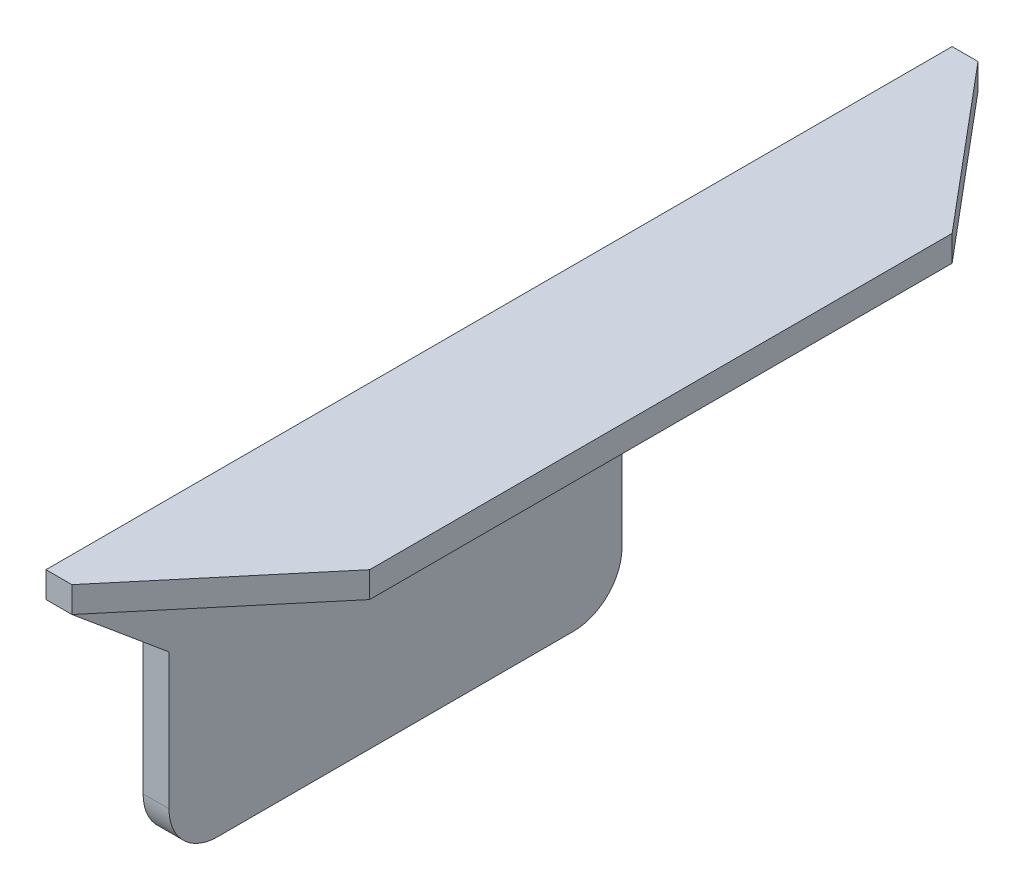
ISO-10303-21;
HEADER;
FILE_DESCRIPTION(('STEP AP214'),'2;1');
FILE_NAME('part.step','',(''),(''),'','','');
FILE_SCHEMA(('AUTOMOTIVE_DESIGN { 1 0 10303 214 1 1 1 1 }'));
ENDSEC;
DATA;
#1=APPLICATION_CONTEXT('core data for automotive mechanical design processes');
#2=APPLICATION_PROTOCOL_DEFINITION('international standard','automotive_design',2000,#1);
#3=PRODUCT_CONTEXT('',#1,'mechanical');
#4=PRODUCT('Part','Part','',(#3));
#5=PRODUCT_RELATED_PRODUCT_CATEGORY('part','',(#4));
#6=PRODUCT_DEFINITION_FORMATION('','',#4);
#7=PRODUCT_DEFINITION_CONTEXT('part definition',#1,'design');
#8=PRODUCT_DEFINITION('design','',#6,#7);
#9=PRODUCT_DEFINITION_SHAPE('','',#8);
#10=(LENGTH_UNIT() NAMED_UNIT(*) SI_UNIT(.MILLI.,.METRE.));
#11=(NAMED_UNIT(*) PLANE_ANGLE_UNIT() SI_UNIT($,.RADIAN.));
#12=(NAMED_UNIT(*) SI_UNIT($,.STERADIAN.) SOLID_ANGLE_UNIT());
#13=UNCERTAINTY_MEASURE_WITH_UNIT(LENGTH_MEASURE(1.E-05),#10,'distance_accuracy_value','');
#14=(GEOMETRIC_REPRESENTATION_CONTEXT(3) GLOBAL_UNCERTAINTY_ASSIGNED_CONTEXT((#13)) GLOBAL_UNIT_ASSIGNED_CONTEXT((#10,
#11,#12)) REPRESENTATION_CONTEXT('',''));
#15=CARTESIAN_POINT('',(0.,0.,0.));
#16=DIRECTION('',(0.,0.,1.));
#17=DIRECTION('',(1.,0.,0.));
#18=AXIS2_PLACEMENT_3D('',#15,#16,#17);
#19=CARTESIAN_POINT('',(0.,0.,280.));
#20=DIRECTION('',(1.,0.,0.));
#21=DIRECTION('',(0.,1.,0.));
#22=AXIS2_PLACEMENT_3D('',#19,#20,#21);
#23=PLANE('',#22);
#24=CARTESIAN_POINT('',(0.,-75.,125.));
#25=DIRECTION('',(1.,0.,0.));
#26=DIRECTION('',(0.,0.,-1.));
#27=AXIS2_PLACEMENT_3D('',#24,#25,#26);
#28=CIRCLE('',#27,15.);
#29=CARTESIAN_POINT('',(0.,-90.,125.));
#30=VERTEX_POINT('',#29);
#31=CARTESIAN_POINT('',(0.,-75.,110.));
#32=VERTEX_POINT('',#31);
#33=EDGE_CURVE('E223',#30,#32,#28,.T.);
#34=ORIENTED_EDGE('',*,*,#33,.F.);
#35=DIRECTION('',(0.,0.,-1.));
#36=VECTOR('',#35,1.);
#37=CARTESIAN_POINT('',(0.,-90.,280.));
#38=LINE('',#37,#36);
#39=CARTESIAN_POINT('',(0.,-90.,235.));
#40=VERTEX_POINT('',#39);
#41=EDGE_CURVE('E179',#40,#30,#38,.T.);
#42=ORIENTED_EDGE('',*,*,#41,.F.);
#43=CARTESIAN_POINT('',(0.,-75.,235.));
#44=DIRECTION('',(1.,0.,0.));
#45=DIRECTION('',(0.,0.,-1.));
#46=AXIS2_PLACEMENT_3D('',#43,#44,#45);
#47=CIRCLE('',#46,15.);
#48=CARTESIAN_POINT('',(0.,-75.,250.));
#49=VERTEX_POINT('',#48);
#50=EDGE_CURVE('E243',#49,#40,#47,.T.);
#51=ORIENTED_EDGE('',*,*,#50,.F.);
#52=DIRECTION('',(0.,-1.,0.));
#53=VECTOR('',#52,1.);
#54=CARTESIAN_POINT('',(0.,-49.,250.));
#55=LINE('',#54,#53);
#56=CARTESIAN_POINT('',(0.,-33.0000000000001,250.));
#57=VERTEX_POINT('',#56);
#58=EDGE_CURVE('E245',#57,#49,#55,.T.);
#59=ORIENTED_EDGE('',*,*,#58,.F.);
#60=DIRECTION('',(0.,-0.640184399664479,-0.768221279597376));
#61=VECTOR('',#60,1.);
#62=CARTESIAN_POINT('',(0.,-205.333235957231,43.2001168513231));
#63=LINE('',#62,#61);
#64=CARTESIAN_POINT('',(0.,-8.00000000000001,280.));
#65=VERTEX_POINT('',#64);
#66=EDGE_CURVE('E248',#65,#57,#63,.T.);
#67=ORIENTED_EDGE('',*,*,#66,.F.);
#68=DIRECTION('',(0.,-1.,0.));
#69=VECTOR('',#68,1.);
#70=CARTESIAN_POINT('',(0.,0.,280.));
#71=LINE('',#70,#69);
#72=CARTESIAN_POINT('',(0.,0.,280.));
#73=VERTEX_POINT('',#72);
#74=EDGE_CURVE('E181',#73,#65,#71,.T.);
#75=ORIENTED_EDGE('',*,*,#74,.F.);
#76=DIRECTION('',(0.,0.,-1.));
#77=VECTOR('',#76,1.);
#78=CARTESIAN_POINT('',(0.,0.,280.));
#79=LINE('',#78,#77);
#80=CARTESIAN_POINT('',(0.,0.,0.));
#81=VERTEX_POINT('',#80);
#82=EDGE_CURVE('E47',#73,#81,#79,.T.);
#83=ORIENTED_EDGE('',*,*,#82,.T.);
#84=DIRECTION('',(0.,-1.,0.));
#85=VECTOR('',#84,1.);
#86=CARTESIAN_POINT('',(0.,0.,0.));
#87=LINE('',#86,#85);
#88=CARTESIAN_POINT('',(0.,-8.,0.));
#89=VERTEX_POINT('',#88);
#90=EDGE_CURVE('E191',#81,#89,#87,.T.);
#91=ORIENTED_EDGE('',*,*,#90,.T.);
#92=DIRECTION('',(0.,0.52999894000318,-0.847998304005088));
#93=VECTOR('',#92,1.);
#94=CARTESIAN_POINT('',(0.,19.6191369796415,-44.1906191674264));
#95=LINE('',#94,#93);
#96=CARTESIAN_POINT('',(0.,-33.,40.));
#97=VERTEX_POINT('',#96);
#98=EDGE_CURVE('E62',#97,#89,#95,.T.);
#99=ORIENTED_EDGE('',*,*,#98,.F.);
#100=DIRECTION('',(0.,0.,-1.));
#101=VECTOR('',#100,1.);
#102=CARTESIAN_POINT('',(0.,-33.,-87.0775797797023));
#103=LINE('',#102,#101);
#104=CARTESIAN_POINT('',(0.,-33.,110.));
#105=VERTEX_POINT('',#104);
#106=EDGE_CURVE('E227',#105,#97,#103,.T.);
#107=ORIENTED_EDGE('',*,*,#106,.F.);
#108=DIRECTION('',(0.,1.,0.));
#109=VECTOR('',#108,1.);
#110=CARTESIAN_POINT('',(0.,-48.9999999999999,110.));
#111=LINE('',#110,#109);
#112=EDGE_CURVE('E229',#32,#105,#111,.T.);
#113=ORIENTED_EDGE('',*,*,#112,.F.);
#114=EDGE_LOOP('',(#34,#42,#51,#59,#67,#75,#83,#91,#99,#107,#113));
#115=FACE_BOUND('',#114,.T.);
#116=ADVANCED_FACE('F39',(#115),#23,.F.);
#117=CARTESIAN_POINT('',(8.00000000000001,-90.,280.));
#118=DIRECTION('',(-1.,0.,0.));
#119=DIRECTION('',(0.,0.,1.));
#120=AXIS2_PLACEMENT_3D('',#117,#118,#119);
#121=PLANE('',#120);
#122=CARTESIAN_POINT('',(8.00000000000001,-75.,125.));
#123=DIRECTION('',(1.,0.,0.));
#124=DIRECTION('',(0.,0.,-1.));
#125=AXIS2_PLACEMENT_3D('',#122,#123,#124);
#126=CIRCLE('',#125,15.);
#127=CARTESIAN_POINT('',(8.00000000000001,-90.,125.));
#128=VERTEX_POINT('',#127);
#129=CARTESIAN_POINT('',(8.00000000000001,-75.,110.));
#130=VERTEX_POINT('',#129);
#131=EDGE_CURVE('E169',#128,#130,#126,.T.);
#132=ORIENTED_EDGE('',*,*,#131,.T.);
#133=DIRECTION('',(0.,1.,0.));
#134=VECTOR('',#133,1.);
#135=CARTESIAN_POINT('',(8.00000000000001,-48.9999999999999,110.));
#136=LINE('',#135,#134);
#137=CARTESIAN_POINT('',(8.00000000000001,-33.,110.));
#138=VERTEX_POINT('',#137);
#139=EDGE_CURVE('E225',#130,#138,#136,.T.);
#140=ORIENTED_EDGE('',*,*,#139,.T.);
#141=DIRECTION('',(0.,0.,-1.));
#142=VECTOR('',#141,1.);
#143=CARTESIAN_POINT('',(8.00000000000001,-33.,-87.0775797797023));
#144=LINE('',#143,#142);
#145=CARTESIAN_POINT('',(8.00000000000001,-33.,40.));
#146=VERTEX_POINT('',#145);
#147=EDGE_CURVE('E168',#138,#146,#144,.T.);
#148=ORIENTED_EDGE('',*,*,#147,.T.);
#149=DIRECTION('',(0.,0.52999894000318,-0.847998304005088));
#150=VECTOR('',#149,1.);
#151=CARTESIAN_POINT('',(8.00000000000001,19.6191369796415,-44.1906191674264));
#152=LINE('',#151,#150);
#153=CARTESIAN_POINT('',(8.00000000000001,-8.,0.));
#154=VERTEX_POINT('',#153);
#155=EDGE_CURVE('E155',#146,#154,#152,.T.);
#156=ORIENTED_EDGE('',*,*,#155,.T.);
#157=DIRECTION('',(0.,0.,-1.));
#158=VECTOR('',#157,1.);
#159=CARTESIAN_POINT('',(8.00000000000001,-8.,280.));
#160=LINE('',#159,#158);
#161=CARTESIAN_POINT('',(8.00000000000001,-8.,280.));
#162=VERTEX_POINT('',#161);
#163=EDGE_CURVE('E165',#162,#154,#160,.T.);
#164=ORIENTED_EDGE('',*,*,#163,.F.);
#165=DIRECTION('',(0.,-0.640184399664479,-0.768221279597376));
#166=VECTOR('',#165,1.);
#167=CARTESIAN_POINT('',(8.00000000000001,-205.333235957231,43.2001168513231));
#168=LINE('',#167,#166);
#169=CARTESIAN_POINT('',(8.00000000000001,-33.0000000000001,250.));
#170=VERTEX_POINT('',#169);
#171=EDGE_CURVE('E246',#162,#170,#168,.T.);
#172=ORIENTED_EDGE('',*,*,#171,.T.);
#173=DIRECTION('',(0.,-1.,0.));
#174=VECTOR('',#173,1.);
#175=CARTESIAN_POINT('',(8.00000000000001,-49.,250.));
#176=LINE('',#175,#174);
#177=CARTESIAN_POINT('',(8.00000000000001,-75.,250.));
#178=VERTEX_POINT('',#177);
#179=EDGE_CURVE('E253',#170,#178,#176,.T.);
#180=ORIENTED_EDGE('',*,*,#179,.T.);
#181=CARTESIAN_POINT('',(8.00000000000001,-75.,235.));
#182=DIRECTION('',(1.,0.,0.));
#183=DIRECTION('',(0.,0.,-1.));
#184=AXIS2_PLACEMENT_3D('',#181,#182,#183);
#185=CIRCLE('',#184,15.);
#186=CARTESIAN_POINT('',(8.00000000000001,-90.,235.));
#187=VERTEX_POINT('',#186);
#188=EDGE_CURVE('E237',#178,#187,#185,.T.);
#189=ORIENTED_EDGE('',*,*,#188,.T.);
#190=DIRECTION('',(0.,0.,-1.));
#191=VECTOR('',#190,1.);
#192=CARTESIAN_POINT('',(8.00000000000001,-90.,280.));
#193=LINE('',#192,#191);
#194=EDGE_CURVE('E175',#187,#128,#193,.T.);
#195=ORIENTED_EDGE('',*,*,#194,.T.);
#196=EDGE_LOOP('',(#132,#140,#148,#156,#164,#172,#180,#189,#195));
#197=FACE_BOUND('',#196,.T.);
#198=ADVANCED_FACE('F163',(#197),#121,.F.);
#199=CARTESIAN_POINT('',(50.,-90.,0.));
#200=DIRECTION('',(0.,0.,-1.));
#201=DIRECTION('',(-1.,0.,0.));
#202=AXIS2_PLACEMENT_3D('',#199,#200,#201);
#203=PLANE('',#202);
#204=DIRECTION('',(0.,-1.,0.));
#205=VECTOR('',#204,1.);
#206=CARTESIAN_POINT('',(8.00000000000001,272.,0.));
#207=LINE('',#206,#205);
#208=CARTESIAN_POINT('',(8.00000000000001,0.,0.));
#209=VERTEX_POINT('',#208);
#210=EDGE_CURVE('E136',#209,#154,#207,.T.);
#211=ORIENTED_EDGE('',*,*,#210,.T.);
#212=DIRECTION('',(1.,0.,0.));
#213=VECTOR('',#212,1.);
#214=CARTESIAN_POINT('',(0.,-8.,0.));
#215=LINE('',#214,#213);
#216=EDGE_CURVE('E147',#89,#154,#215,.T.);
#217=ORIENTED_EDGE('',*,*,#216,.F.);
#218=ORIENTED_EDGE('',*,*,#90,.F.);
#219=DIRECTION('',(-1.,0.,0.));
#220=VECTOR('',#219,1.);
#221=CARTESIAN_POINT('',(50.,0.,0.));
#222=LINE('',#221,#220);
#223=EDGE_CURVE('E149',#209,#81,#222,.T.);
#224=ORIENTED_EDGE('',*,*,#223,.F.);
#225=EDGE_LOOP('',(#211,#217,#218,#224));
#226=FACE_BOUND('',#225,.T.);
#227=ADVANCED_FACE('F145',(#226),#203,.T.);
#228=CARTESIAN_POINT('',(0.,-90.,280.));
#229=DIRECTION('',(0.,1.,0.));
#230=DIRECTION('',(0.,0.,1.));
#231=AXIS2_PLACEMENT_3D('',#228,#229,#230);
#232=PLANE('',#231);
#233=ORIENTED_EDGE('',*,*,#41,.T.);
#234=DIRECTION('',(1.,0.,0.));
#235=VECTOR('',#234,1.);
#236=CARTESIAN_POINT('',(0.,-90.,125.));
#237=LINE('',#236,#235);
#238=EDGE_CURVE('E158',#30,#128,#237,.T.);
#239=ORIENTED_EDGE('',*,*,#238,.T.);
#240=ORIENTED_EDGE('',*,*,#194,.F.);
#241=DIRECTION('',(1.,0.,0.));
#242=VECTOR('',#241,1.);
#243=CARTESIAN_POINT('',(0.,-90.,235.));
#244=LINE('',#243,#242);
#245=EDGE_CURVE('E199',#40,#187,#244,.T.);
#246=ORIENTED_EDGE('',*,*,#245,.F.);
#247=EDGE_LOOP('',(#233,#239,#240,#246));
#248=FACE_BOUND('',#247,.T.);
#249=ADVANCED_FACE('F276',(#248),#232,.F.);
#250=CARTESIAN_POINT('',(50.,-90.,280.));
#251=DIRECTION('',(0.,0.,-1.));
#252=DIRECTION('',(-1.,0.,0.));
#253=AXIS2_PLACEMENT_3D('',#250,#251,#252);
#254=PLANE('',#253);
#255=DIRECTION('',(1.,0.,0.));
#256=VECTOR('',#255,1.);
#257=CARTESIAN_POINT('',(0.,-8.00000000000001,280.));
#258=LINE('',#257,#256);
#259=EDGE_CURVE('E206',#65,#162,#258,.T.);
#260=ORIENTED_EDGE('',*,*,#259,.T.);
#261=DIRECTION('',(0.,-1.,0.));
#262=VECTOR('',#261,1.);
#263=CARTESIAN_POINT('',(8.00000000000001,272.,280.));
#264=LINE('',#263,#262);
#265=CARTESIAN_POINT('',(8.00000000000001,0.,280.));
#266=VERTEX_POINT('',#265);
#267=EDGE_CURVE('E207',#266,#162,#264,.T.);
#268=ORIENTED_EDGE('',*,*,#267,.F.);
#269=DIRECTION('',(-1.,0.,0.));
#270=VECTOR('',#269,1.);
#271=CARTESIAN_POINT('',(50.,0.,280.));
#272=LINE('',#271,#270);
#273=EDGE_CURVE('E196',#266,#73,#272,.T.);
#274=ORIENTED_EDGE('',*,*,#273,.T.);
#275=ORIENTED_EDGE('',*,*,#74,.T.);
#276=EDGE_LOOP('',(#260,#268,#274,#275));
#277=FACE_BOUND('',#276,.T.);
#278=ADVANCED_FACE('F204',(#277),#254,.F.);
#279=CARTESIAN_POINT('',(50.,-8.,280.));
#280=DIRECTION('',(-1.,0.,0.));
#281=DIRECTION('',(0.,0.,1.));
#282=AXIS2_PLACEMENT_3D('',#279,#280,#281);
#283=PLANE('',#282);
#284=DIRECTION('',(0.,0.,-1.));
#285=VECTOR('',#284,1.);
#286=CARTESIAN_POINT('',(50.,-8.,280.));
#287=LINE('',#286,#285);
#288=CARTESIAN_POINT('',(50.,-8.,230.));
#289=VERTEX_POINT('',#288);
#290=CARTESIAN_POINT('',(50.,-8.,50.0000000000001));
#291=VERTEX_POINT('',#290);
#292=EDGE_CURVE('E176',#289,#291,#287,.T.);
#293=ORIENTED_EDGE('',*,*,#292,.T.);
#294=DIRECTION('',(0.,-1.,0.));
#295=VECTOR('',#294,1.);
#296=CARTESIAN_POINT('',(50.,272.,50.));
#297=LINE('',#296,#295);
#298=CARTESIAN_POINT('',(50.,0.,50.));
#299=VERTEX_POINT('',#298);
#300=EDGE_CURVE('E54',#299,#291,#297,.T.);
#301=ORIENTED_EDGE('',*,*,#300,.F.);
#302=DIRECTION('',(0.,0.,-1.));
#303=VECTOR('',#302,1.);
#304=CARTESIAN_POINT('',(50.,0.,280.));
#305=LINE('',#304,#303);
#306=CARTESIAN_POINT('',(50.,0.,230.));
#307=VERTEX_POINT('',#306);
#308=EDGE_CURVE('E11',#307,#299,#305,.T.);
#309=ORIENTED_EDGE('',*,*,#308,.F.);
#310=DIRECTION('',(0.,-1.,0.));
#311=VECTOR('',#310,1.);
#312=CARTESIAN_POINT('',(50.,272.,230.));
#313=LINE('',#312,#311);
#314=EDGE_CURVE('E213',#307,#289,#313,.T.);
#315=ORIENTED_EDGE('',*,*,#314,.T.);
#316=EDGE_LOOP('',(#293,#301,#309,#315));
#317=FACE_BOUND('',#316,.T.);
#318=ADVANCED_FACE('F41',(#317),#283,.F.);
#319=CARTESIAN_POINT('',(50.,0.,280.));
#320=DIRECTION('',(0.,-1.,0.));
#321=DIRECTION('',(1.,0.,0.));
#322=AXIS2_PLACEMENT_3D('',#319,#320,#321);
#323=PLANE('',#322);
#324=ORIENTED_EDGE('',*,*,#308,.T.);
#325=DIRECTION('',(-0.643192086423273,0.,-0.765704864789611));
#326=VECTOR('',#325,1.);
#327=CARTESIAN_POINT('',(163.27392120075,0.,184.84990619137));
#328=LINE('',#327,#326);
#329=EDGE_CURVE('E150',#299,#209,#328,.T.);
#330=ORIENTED_EDGE('',*,*,#329,.T.);
#331=ORIENTED_EDGE('',*,*,#223,.T.);
#332=ORIENTED_EDGE('',*,*,#82,.F.);
#333=ORIENTED_EDGE('',*,*,#273,.F.);
#334=DIRECTION('',(0.643192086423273,0.,-0.765704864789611));
#335=VECTOR('',#334,1.);
#336=CARTESIAN_POINT('',(25.375234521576,0.,259.315196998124));
#337=LINE('',#336,#335);
#338=EDGE_CURVE('E210',#266,#307,#337,.T.);
#339=ORIENTED_EDGE('',*,*,#338,.T.);
#340=EDGE_LOOP('',(#324,#330,#331,#332,#333,#339));
#341=FACE_BOUND('',#340,.T.);
#342=ADVANCED_FACE('F209',(#341),#323,.F.);
#343=CARTESIAN_POINT('',(8.00000000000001,-8.,280.));
#344=DIRECTION('',(0.,1.,0.));
#345=DIRECTION('',(0.,0.,1.));
#346=AXIS2_PLACEMENT_3D('',#343,#344,#345);
#347=PLANE('',#346);
#348=ORIENTED_EDGE('',*,*,#163,.T.);
#349=DIRECTION('',(-0.643192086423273,0.,-0.765704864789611));
#350=VECTOR('',#349,1.);
#351=CARTESIAN_POINT('',(-22.8926576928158,-8.,-36.7769734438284));
#352=LINE('',#351,#350);
#353=EDGE_CURVE('E133',#291,#154,#352,.T.);
#354=ORIENTED_EDGE('',*,*,#353,.F.);
#355=ORIENTED_EDGE('',*,*,#292,.F.);
#356=DIRECTION('',(0.643192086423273,0.,-0.765704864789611));
#357=VECTOR('',#356,1.);
#358=CARTESIAN_POINT('',(194.166578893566,-8.,58.3731203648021));
#359=LINE('',#358,#357);
#360=EDGE_CURVE('E173',#162,#289,#359,.T.);
#361=ORIENTED_EDGE('',*,*,#360,.F.);
#362=EDGE_LOOP('',(#348,#354,#355,#361));
#363=FACE_BOUND('',#362,.T.);
#364=ADVANCED_FACE('F172',(#363),#347,.F.);
#365=CARTESIAN_POINT('',(0.,-75.,235.));
#366=DIRECTION('',(1.,0.,0.));
#367=DIRECTION('',(0.,0.,-1.));
#368=AXIS2_PLACEMENT_3D('',#365,#366,#367);
#369=CYLINDRICAL_SURFACE('',#368,15.);
#370=ORIENTED_EDGE('',*,*,#188,.F.);
#371=DIRECTION('',(1.,0.,0.));
#372=VECTOR('',#371,1.);
#373=CARTESIAN_POINT('',(0.,-75.,250.));
#374=LINE('',#373,#372);
#375=EDGE_CURVE('E250',#49,#178,#374,.T.);
#376=ORIENTED_EDGE('',*,*,#375,.F.);
#377=ORIENTED_EDGE('',*,*,#50,.T.);
#378=ORIENTED_EDGE('',*,*,#245,.T.);
#379=EDGE_LOOP('',(#370,#376,#377,#378));
#380=FACE_BOUND('',#379,.T.);
#381=ADVANCED_FACE('F269',(#380),#369,.T.);
#382=CARTESIAN_POINT('',(0.,-205.333235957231,43.2001168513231));
#383=DIRECTION('',(0.,-0.768221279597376,0.640184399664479));
#384=DIRECTION('',(0.,-0.640184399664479,-0.768221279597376));
#385=AXIS2_PLACEMENT_3D('',#382,#383,#384);
#386=PLANE('',#385);
#387=ORIENTED_EDGE('',*,*,#171,.F.);
#388=ORIENTED_EDGE('',*,*,#259,.F.);
#389=ORIENTED_EDGE('',*,*,#66,.T.);
#390=DIRECTION('',(1.,0.,0.));
#391=VECTOR('',#390,1.);
#392=CARTESIAN_POINT('',(0.,-33.0000000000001,250.));
#393=LINE('',#392,#391);
#394=EDGE_CURVE('E259',#57,#170,#393,.T.);
#395=ORIENTED_EDGE('',*,*,#394,.T.);
#396=EDGE_LOOP('',(#387,#388,#389,#395));
#397=FACE_BOUND('',#396,.T.);
#398=ADVANCED_FACE('F273',(#397),#386,.T.);
#399=CARTESIAN_POINT('',(0.,-49.,250.));
#400=DIRECTION('',(0.,0.,1.));
#401=DIRECTION('',(1.,0.,0.));
#402=AXIS2_PLACEMENT_3D('',#399,#400,#401);
#403=PLANE('',#402);
#404=ORIENTED_EDGE('',*,*,#179,.F.);
#405=ORIENTED_EDGE('',*,*,#394,.F.);
#406=ORIENTED_EDGE('',*,*,#58,.T.);
#407=ORIENTED_EDGE('',*,*,#375,.T.);
#408=EDGE_LOOP('',(#404,#405,#406,#407));
#409=FACE_BOUND('',#408,.T.);
#410=ADVANCED_FACE('F264',(#409),#403,.T.);
#411=CARTESIAN_POINT('',(0.,-75.,125.));
#412=DIRECTION('',(1.,0.,0.));
#413=DIRECTION('',(0.,0.,-1.));
#414=AXIS2_PLACEMENT_3D('',#411,#412,#413);
#415=CYLINDRICAL_SURFACE('',#414,15.);
#416=ORIENTED_EDGE('',*,*,#131,.F.);
#417=ORIENTED_EDGE('',*,*,#238,.F.);
#418=ORIENTED_EDGE('',*,*,#33,.T.);
#419=DIRECTION('',(1.,0.,0.));
#420=VECTOR('',#419,1.);
#421=CARTESIAN_POINT('',(0.,-75.,110.));
#422=LINE('',#421,#420);
#423=EDGE_CURVE('E234',#32,#130,#422,.T.);
#424=ORIENTED_EDGE('',*,*,#423,.T.);
#425=EDGE_LOOP('',(#416,#417,#418,#424));
#426=FACE_BOUND('',#425,.T.);
#427=ADVANCED_FACE('F278',(#426),#415,.T.);
#428=CARTESIAN_POINT('',(0.,-48.9999999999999,110.));
#429=DIRECTION('',(0.,0.,-1.));
#430=DIRECTION('',(0.,1.,0.));
#431=AXIS2_PLACEMENT_3D('',#428,#429,#430);
#432=PLANE('',#431);
#433=ORIENTED_EDGE('',*,*,#139,.F.);
#434=ORIENTED_EDGE('',*,*,#423,.F.);
#435=ORIENTED_EDGE('',*,*,#112,.T.);
#436=DIRECTION('',(1.,0.,0.));
#437=VECTOR('',#436,1.);
#438=CARTESIAN_POINT('',(0.,-33.,110.));
#439=LINE('',#438,#437);
#440=EDGE_CURVE('E238',#105,#138,#439,.T.);
#441=ORIENTED_EDGE('',*,*,#440,.T.);
#442=EDGE_LOOP('',(#433,#434,#435,#441));
#443=FACE_BOUND('',#442,.T.);
#444=ADVANCED_FACE('F282',(#443),#432,.T.);
#445=CARTESIAN_POINT('',(0.,-33.,-87.0775797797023));
#446=DIRECTION('',(0.,-1.,0.));
#447=DIRECTION('',(0.,0.,-1.));
#448=AXIS2_PLACEMENT_3D('',#445,#446,#447);
#449=PLANE('',#448);
#450=ORIENTED_EDGE('',*,*,#147,.F.);
#451=ORIENTED_EDGE('',*,*,#440,.F.);
#452=ORIENTED_EDGE('',*,*,#106,.T.);
#453=DIRECTION('',(1.,0.,0.));
#454=VECTOR('',#453,1.);
#455=CARTESIAN_POINT('',(0.,-33.,40.));
#456=LINE('',#455,#454);
#457=EDGE_CURVE('E157',#97,#146,#456,.T.);
#458=ORIENTED_EDGE('',*,*,#457,.T.);
#459=EDGE_LOOP('',(#450,#451,#452,#458));
#460=FACE_BOUND('',#459,.T.);
#461=ADVANCED_FACE('F286',(#460),#449,.T.);
#462=CARTESIAN_POINT('',(0.,19.6191369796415,-44.1906191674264));
#463=DIRECTION('',(0.,-0.847998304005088,-0.52999894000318));
#464=DIRECTION('',(0.,0.52999894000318,-0.847998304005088));
#465=AXIS2_PLACEMENT_3D('',#462,#463,#464);
#466=PLANE('',#465);
#467=ORIENTED_EDGE('',*,*,#155,.F.);
#468=ORIENTED_EDGE('',*,*,#457,.F.);
#469=ORIENTED_EDGE('',*,*,#98,.T.);
#470=ORIENTED_EDGE('',*,*,#216,.T.);
#471=EDGE_LOOP('',(#467,#468,#469,#470));
#472=FACE_BOUND('',#471,.T.);
#473=ADVANCED_FACE('F154',(#472),#466,.T.);
#474=CARTESIAN_POINT('',(194.166578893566,272.,58.3731203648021));
#475=DIRECTION('',(-0.765704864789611,0.,-0.643192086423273));
#476=DIRECTION('',(-0.643192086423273,0.,0.765704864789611));
#477=AXIS2_PLACEMENT_3D('',#474,#475,#476);
#478=PLANE('',#477);
#479=ORIENTED_EDGE('',*,*,#267,.T.);
#480=ORIENTED_EDGE('',*,*,#360,.T.);
#481=ORIENTED_EDGE('',*,*,#314,.F.);
#482=ORIENTED_EDGE('',*,*,#338,.F.);
#483=EDGE_LOOP('',(#479,#480,#481,#482));
#484=FACE_BOUND('',#483,.T.);
#485=ADVANCED_FACE('F294',(#484),#478,.F.);
#486=CARTESIAN_POINT('',(-22.8926576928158,272.,-36.7769734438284));
#487=DIRECTION('',(-0.765704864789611,0.,0.643192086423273));
#488=DIRECTION('',(0.643192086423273,0.,0.765704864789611));
#489=AXIS2_PLACEMENT_3D('',#486,#487,#488);
#490=PLANE('',#489);
#491=ORIENTED_EDGE('',*,*,#300,.T.);
#492=ORIENTED_EDGE('',*,*,#353,.T.);
#493=ORIENTED_EDGE('',*,*,#210,.F.);
#494=ORIENTED_EDGE('',*,*,#329,.F.);
#495=EDGE_LOOP('',(#491,#492,#493,#494));
#496=FACE_BOUND('',#495,.T.);
#497=ADVANCED_FACE('F135',(#496),#490,.F.);
#498=CLOSED_SHELL('',(#116,#198,#227,#249,#278,#318,#342,#364,#381,#398,#410,#427,#444,#461,
#473,#485,#497));
#499=MANIFOLD_SOLID_BREP('B2',#498);
#500=ADVANCED_BREP_SHAPE_REPRESENTATION('',(#18,#499),#14);
#501=SHAPE_DEFINITION_REPRESENTATION(#9,#500);
ENDSEC;
END-ISO-10303-21;
